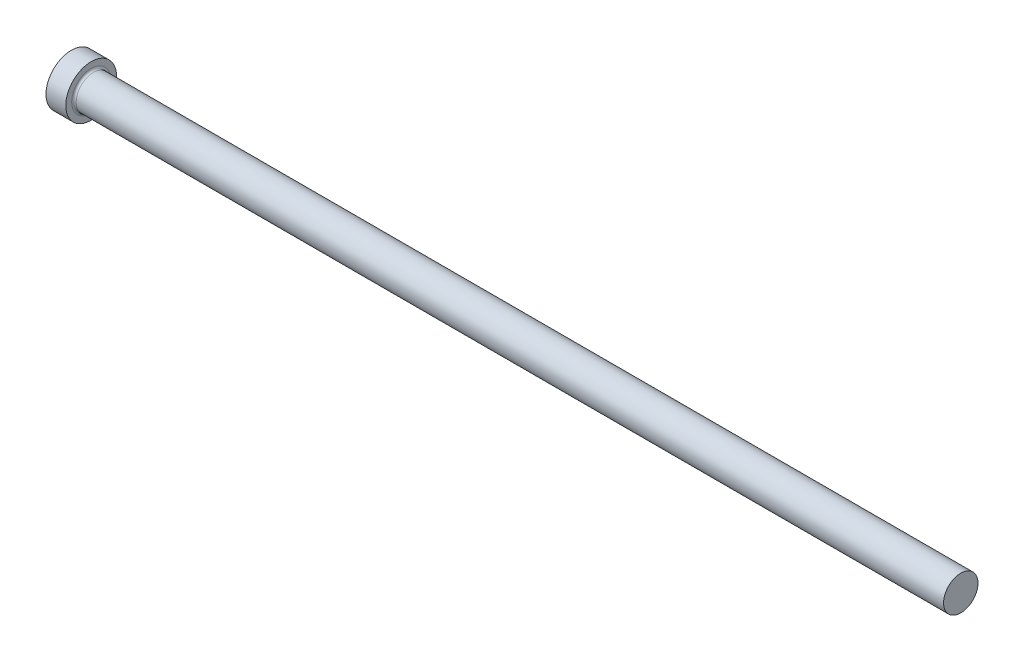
ISO-10303-21;
HEADER;
FILE_DESCRIPTION(('STEP AP214'),'2;1');
FILE_NAME('part.step','',(''),(''),'','','');
FILE_SCHEMA(('AUTOMOTIVE_DESIGN { 1 0 10303 214 1 1 1 1 }'));
ENDSEC;
DATA;
#1=APPLICATION_CONTEXT('core data for automotive mechanical design processes');
#2=APPLICATION_PROTOCOL_DEFINITION('international standard','automotive_design',2000,#1);
#3=PRODUCT_CONTEXT('',#1,'mechanical');
#4=PRODUCT('Part','Part','',(#3));
#5=PRODUCT_RELATED_PRODUCT_CATEGORY('part','',(#4));
#6=PRODUCT_DEFINITION_FORMATION('','',#4);
#7=PRODUCT_DEFINITION_CONTEXT('part definition',#1,'design');
#8=PRODUCT_DEFINITION('design','',#6,#7);
#9=PRODUCT_DEFINITION_SHAPE('','',#8);
#10=(LENGTH_UNIT() NAMED_UNIT(*) SI_UNIT(.MILLI.,.METRE.));
#11=(NAMED_UNIT(*) PLANE_ANGLE_UNIT() SI_UNIT($,.RADIAN.));
#12=(NAMED_UNIT(*) SI_UNIT($,.STERADIAN.) SOLID_ANGLE_UNIT());
#13=UNCERTAINTY_MEASURE_WITH_UNIT(LENGTH_MEASURE(1.E-05),#10,'distance_accuracy_value','');
#14=(GEOMETRIC_REPRESENTATION_CONTEXT(3) GLOBAL_UNCERTAINTY_ASSIGNED_CONTEXT((#13)) GLOBAL_UNIT_ASSIGNED_CONTEXT((#10,
#11,#12)) REPRESENTATION_CONTEXT('',''));
#15=CARTESIAN_POINT('',(0.,0.,0.));
#16=DIRECTION('',(0.,0.,1.));
#17=DIRECTION('',(1.,0.,0.));
#18=AXIS2_PLACEMENT_3D('',#15,#16,#17);
#19=CARTESIAN_POINT('',(0.,0.,0.));
#20=DIRECTION('',(-1.,0.,0.));
#21=DIRECTION('',(0.,-1.,0.));
#22=AXIS2_PLACEMENT_3D('',#19,#20,#21);
#23=PLANE('',#22);
#24=CARTESIAN_POINT('',(0.,0.,0.));
#25=DIRECTION('',(1.,0.,0.));
#26=DIRECTION('',(0.,1.,0.));
#27=AXIS2_PLACEMENT_3D('',#24,#25,#26);
#28=CIRCLE('',#27,9.);
#29=CARTESIAN_POINT('',(0.,9.,0.));
#30=VERTEX_POINT('',#29);
#31=EDGE_CURVE('E25',#30,#30,#28,.T.);
#32=ORIENTED_EDGE('',*,*,#31,.F.);
#33=EDGE_LOOP('',(#32));
#34=FACE_BOUND('',#33,.T.);
#35=ADVANCED_FACE('F14',(#34),#23,.T.);
#36=CARTESIAN_POINT('',(315.,0.,0.));
#37=DIRECTION('',(1.,0.,0.));
#38=DIRECTION('',(0.,1.,0.));
#39=AXIS2_PLACEMENT_3D('',#36,#37,#38);
#40=CYLINDRICAL_SURFACE('',#39,9.);
#41=ORIENTED_EDGE('',*,*,#31,.T.);
#42=EDGE_LOOP('',(#41));
#43=FACE_BOUND('',#42,.T.);
#44=CARTESIAN_POINT('',(7.,0.,0.));
#45=DIRECTION('',(1.,0.,0.));
#46=DIRECTION('',(0.,1.,0.));
#47=AXIS2_PLACEMENT_3D('',#44,#45,#46);
#48=CIRCLE('',#47,9.);
#49=CARTESIAN_POINT('',(7.,9.,0.));
#50=VERTEX_POINT('',#49);
#51=EDGE_CURVE('E29',#50,#50,#48,.T.);
#52=ORIENTED_EDGE('',*,*,#51,.F.);
#53=EDGE_LOOP('',(#52));
#54=FACE_BOUND('',#53,.T.);
#55=ADVANCED_FACE('F51',(#43,#54),#40,.T.);
#56=CARTESIAN_POINT('',(7.,9.,0.));
#57=DIRECTION('',(1.,0.,0.));
#58=DIRECTION('',(0.,1.,0.));
#59=AXIS2_PLACEMENT_3D('',#56,#57,#58);
#60=PLANE('',#59);
#61=CARTESIAN_POINT('',(7.,0.,0.));
#62=DIRECTION('',(1.,0.,0.));
#63=DIRECTION('',(0.,1.,0.));
#64=AXIS2_PLACEMENT_3D('',#61,#62,#63);
#65=CIRCLE('',#64,6.9);
#66=CARTESIAN_POINT('',(7.,6.9,0.));
#67=VERTEX_POINT('',#66);
#68=EDGE_CURVE('E9',#67,#67,#65,.F.);
#69=ORIENTED_EDGE('',*,*,#68,.T.);
#70=EDGE_LOOP('',(#69));
#71=FACE_BOUND('',#70,.T.);
#72=ORIENTED_EDGE('',*,*,#51,.T.);
#73=EDGE_LOOP('',(#72));
#74=FACE_BOUND('',#73,.T.);
#75=ADVANCED_FACE('F42',(#71,#74),#60,.T.);
#76=CARTESIAN_POINT('',(315.,0.,0.));
#77=DIRECTION('',(1.,0.,0.));
#78=DIRECTION('',(0.,1.,0.));
#79=AXIS2_PLACEMENT_3D('',#76,#77,#78);
#80=CYLINDRICAL_SURFACE('',#79,6.1);
#81=CARTESIAN_POINT('',(7.8,0.,0.));
#82=DIRECTION('',(1.,0.,0.));
#83=DIRECTION('',(0.,1.,0.));
#84=AXIS2_PLACEMENT_3D('',#81,#82,#83);
#85=CIRCLE('',#84,6.1);
#86=CARTESIAN_POINT('',(7.8,6.1,0.));
#87=VERTEX_POINT('',#86);
#88=EDGE_CURVE('E21',#87,#87,#85,.T.);
#89=ORIENTED_EDGE('',*,*,#88,.T.);
#90=EDGE_LOOP('',(#89));
#91=FACE_BOUND('',#90,.T.);
#92=CARTESIAN_POINT('',(315.,0.,0.));
#93=DIRECTION('',(1.,0.,0.));
#94=DIRECTION('',(0.,1.,0.));
#95=AXIS2_PLACEMENT_3D('',#92,#93,#94);
#96=CIRCLE('',#95,6.1);
#97=CARTESIAN_POINT('',(315.,6.10000000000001,0.));
#98=VERTEX_POINT('',#97);
#99=EDGE_CURVE('E34',#98,#98,#96,.T.);
#100=ORIENTED_EDGE('',*,*,#99,.F.);
#101=EDGE_LOOP('',(#100));
#102=FACE_BOUND('',#101,.T.);
#103=ADVANCED_FACE('F40',(#91,#102),#80,.T.);
#104=CARTESIAN_POINT('',(315.,6.1,0.));
#105=DIRECTION('',(1.,0.,0.));
#106=DIRECTION('',(0.,1.,0.));
#107=AXIS2_PLACEMENT_3D('',#104,#105,#106);
#108=PLANE('',#107);
#109=ORIENTED_EDGE('',*,*,#99,.T.);
#110=EDGE_LOOP('',(#109));
#111=FACE_BOUND('',#110,.T.);
#112=ADVANCED_FACE('F38',(#111),#108,.T.);
#113=CARTESIAN_POINT('',(7.8,0.,0.));
#114=DIRECTION('',(1.,0.,0.));
#115=DIRECTION('',(0.,1.,0.));
#116=AXIS2_PLACEMENT_3D('',#113,#114,#115);
#117=TOROIDAL_SURFACE('',#116,6.9,0.8);
#118=ORIENTED_EDGE('',*,*,#68,.F.);
#119=EDGE_LOOP('',(#118));
#120=FACE_BOUND('',#119,.T.);
#121=ORIENTED_EDGE('',*,*,#88,.F.);
#122=EDGE_LOOP('',(#121));
#123=FACE_BOUND('',#122,.T.);
#124=ADVANCED_FACE('F16',(#120,#123),#117,.F.);
#125=CLOSED_SHELL('',(#35,#55,#75,#103,#112,#124));
#126=MANIFOLD_SOLID_BREP('B1',#125);
#127=ADVANCED_BREP_SHAPE_REPRESENTATION('',(#18,#126),#14);
#128=SHAPE_DEFINITION_REPRESENTATION(#9,#127);
ENDSEC;
END-ISO-10303-21;
